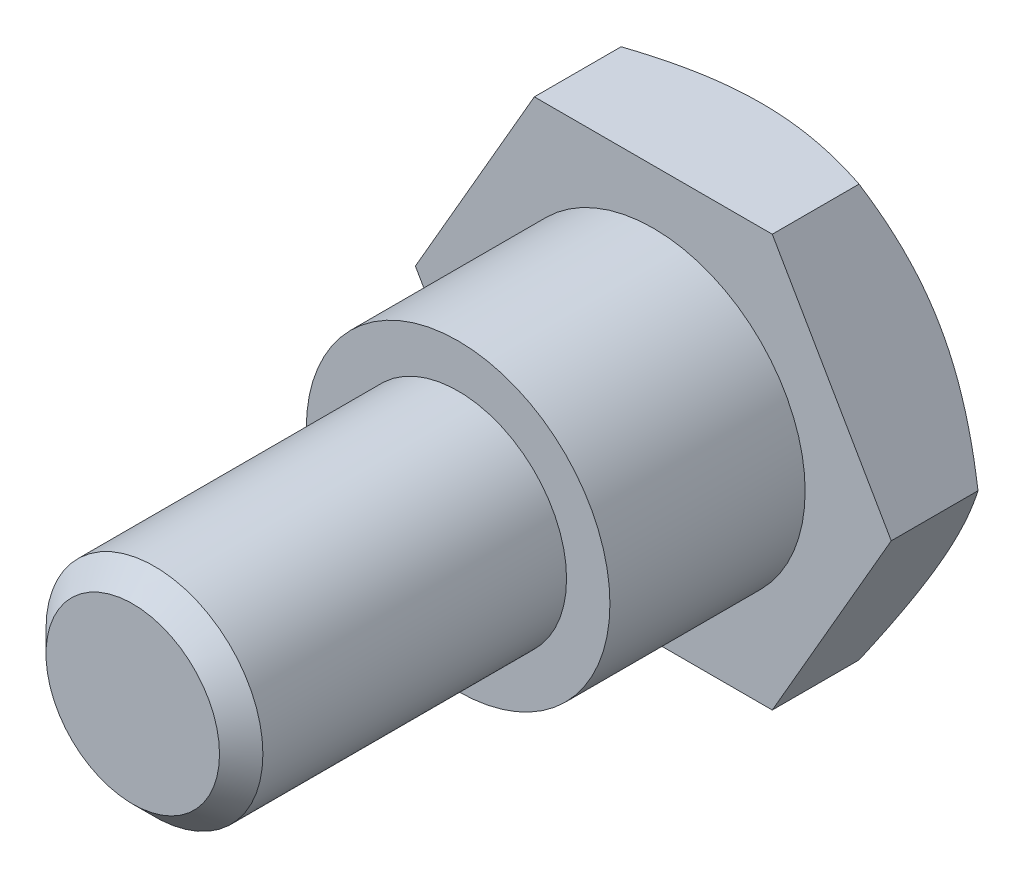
from build123d import *

# Parameters (mm, degrees)
VYSUNOUT1_DEPTH          = 29
ODEBRAT_START            = -5
SKICA2_OUTSIDE_W         = 32.146
SKICA2_OUTSIDE_H         = 29.206
SKICA2_OUTSIDE_R         = 7
ODEBRAT_VYSUNUT_M1_DEPTH = 32
SKICA3_OUTSIDE_W         = 32.146
SKICA3_OUTSIDE_H         = 29.206
SKICA3_OUTSIDE_R         = 5
ODEBRAT_VYSUNUT_M2_DEPTH = 15
ZKOSIT2_SIZE             = 1


with BuildPart() as part:
    # Skica1 → Vysunout1 (new body)
    with BuildSketch(Plane.XY):
        Polygon((-5.484827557, 9.5), (-10.969655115, 0), (-5.484827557, -9.5), (5.484827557, -9.5), (10.969655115, 0), (5.484827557, 9.5), align=None)
    extrude(amount=VYSUNOUT1_DEPTH)

    # Skica2 outside → Odebrat vysunut_m1 (cut)
    with BuildSketch(Plane(origin=(0, 0, 0), x_dir=(-1, 0, 0), z_dir=(0, 0, -1)).offset(ODEBRAT_START)):
        Rectangle(SKICA2_OUTSIDE_W, SKICA2_OUTSIDE_H)
        Circle(SKICA2_OUTSIDE_R, mode=Mode.SUBTRACT)
    extrude(amount=-ODEBRAT_VYSUNUT_M1_DEPTH, mode=Mode.SUBTRACT)

    # Skica3 outside → Odebrat vysunut_m2 (cut)
    with BuildSketch(Plane.XY.offset(29)):
        Rectangle(SKICA3_OUTSIDE_W, SKICA3_OUTSIDE_H)
        Circle(SKICA3_OUTSIDE_R, mode=Mode.SUBTRACT)
    extrude(amount=-ODEBRAT_VYSUNUT_M2_DEPTH, mode=Mode.SUBTRACT)

    # Zkosit2
    zkosit2_edges = [part.edges().sort_by_distance(p)[0] for p in [
        (-5, 0, 29),
    ]]
    chamfer(zkosit2_edges, length=ZKOSIT2_SIZE)

    # Skica4 → Odebrat oto_en_m1 (revolve, cut)
    with BuildSketch(Plane(origin=(0, 0, 0), x_dir=(1, 0, 0), z_dir=(0, 1, 0)), mode=Mode.PRIVATE) as odebrat_oto_en_m1_sk:
        Polygon((-9.469655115, 0), (-10.969655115, -1), (-10.969655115, 0), align=None)
    revolve(odebrat_oto_en_m1_sk.sketch.rotate(Axis((0, 0, 37), (0, 0, -1)), 180), axis=Axis((0, 0, 37), (0, 0, -1)), mode=Mode.SUBTRACT)


solid = part.part
